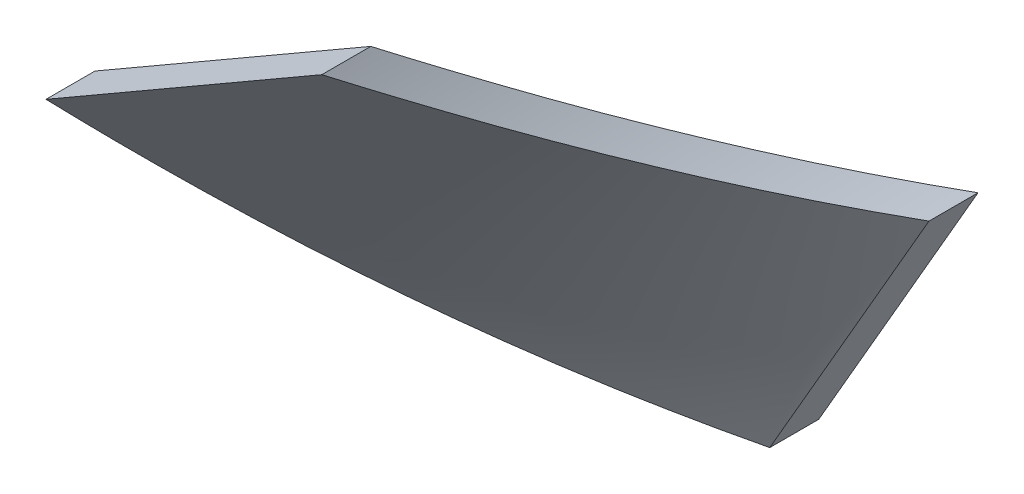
ISO-10303-21;
HEADER;
FILE_DESCRIPTION(('STEP AP214'),'2;1');
FILE_NAME('part.step','',(''),(''),'','','');
FILE_SCHEMA(('AUTOMOTIVE_DESIGN { 1 0 10303 214 1 1 1 1 }'));
ENDSEC;
DATA;
#1=APPLICATION_CONTEXT('core data for automotive mechanical design processes');
#2=APPLICATION_PROTOCOL_DEFINITION('international standard','automotive_design',2000,#1);
#3=PRODUCT_CONTEXT('',#1,'mechanical');
#4=PRODUCT('Part','Part','',(#3));
#5=PRODUCT_RELATED_PRODUCT_CATEGORY('part','',(#4));
#6=PRODUCT_DEFINITION_FORMATION('','',#4);
#7=PRODUCT_DEFINITION_CONTEXT('part definition',#1,'design');
#8=PRODUCT_DEFINITION('design','',#6,#7);
#9=PRODUCT_DEFINITION_SHAPE('','',#8);
#10=(LENGTH_UNIT() NAMED_UNIT(*) SI_UNIT(.MILLI.,.METRE.));
#11=(NAMED_UNIT(*) PLANE_ANGLE_UNIT() SI_UNIT($,.RADIAN.));
#12=(NAMED_UNIT(*) SI_UNIT($,.STERADIAN.) SOLID_ANGLE_UNIT());
#13=UNCERTAINTY_MEASURE_WITH_UNIT(LENGTH_MEASURE(1.E-05),#10,'distance_accuracy_value','');
#14=(GEOMETRIC_REPRESENTATION_CONTEXT(3) GLOBAL_UNCERTAINTY_ASSIGNED_CONTEXT((#13)) GLOBAL_UNIT_ASSIGNED_CONTEXT((#10,
#11,#12)) REPRESENTATION_CONTEXT('',''));
#15=CARTESIAN_POINT('',(0.,0.,0.));
#16=DIRECTION('',(0.,0.,1.));
#17=DIRECTION('',(1.,0.,0.));
#18=AXIS2_PLACEMENT_3D('',#15,#16,#17);
#19=CARTESIAN_POINT('',(-5.9999999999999,-10.3923048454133,2.));
#20=CARTESIAN_POINT('',(-6.96298885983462,-9.83632296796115,3.41176470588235));
#21=CARTESIAN_POINT('',(-7.80741960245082,-9.11285899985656,4.82352941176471));
#22=CARTESIAN_POINT('',(-8.65185034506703,-8.38939503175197,6.23529411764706));
#23=CARTESIAN_POINT('',(-9.34896689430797,-7.52308567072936,7.64705882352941));
#24=CARTESIAN_POINT('',(-9.92927662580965,-6.80193258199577,8.82227234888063));
#25=CARTESIAN_POINT('',(-10.3921239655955,-6.00031328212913,10.0002842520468));
#26=CARTESIAN_POINT('',(-10.4078274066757,-5.97311601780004,10.0402517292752));
#27=CARTESIAN_POINT('',(-10.4235308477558,-5.94591875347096,10.0802192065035));
#28=CARTESIAN_POINT('',(-9.24999999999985,-16.0214699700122,2.));
#29=CARTESIAN_POINT('',(-10.7346078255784,-15.1643312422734,3.41176470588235));
#30=CARTESIAN_POINT('',(-12.0364385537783,-14.0489909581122,4.82352941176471));
#31=CARTESIAN_POINT('',(-13.3382692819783,-12.933650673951,6.23529411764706));
#32=CARTESIAN_POINT('',(-14.4129906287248,-11.5980904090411,7.64705882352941));
#33=CARTESIAN_POINT('',(-15.3076347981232,-10.4863127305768,8.82227234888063));
#34=CARTESIAN_POINT('',(-16.0211911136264,-9.25048297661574,10.0002842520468));
#35=CARTESIAN_POINT('',(-16.0454005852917,-9.20855386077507,10.0402517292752));
#36=CARTESIAN_POINT('',(-16.0696100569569,-9.1666247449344,10.0802192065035));
#37=(BOUNDED_SURFACE() B_SPLINE_SURFACE(1,2,((#19,#20,#21,#22,#23,#24,#25,#26,#27),(#28,#29,#30,
#31,#32,#33,#34,#35,#36)),.UNSPECIFIED.,.F.,.F.,.F.) B_SPLINE_SURFACE_WITH_KNOTS((2,2),(3,2,2,2,
3),(0.,1.),(0.,0.0294117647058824,0.0588235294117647,0.0833246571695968,0.0841579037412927),
.UNSPECIFIED.) GEOMETRIC_REPRESENTATION_ITEM() RATIONAL_B_SPLINE_SURFACE(((1.,0.995734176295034,
1.,0.995734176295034,1.,0.996446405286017,0.99881337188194,0.99881337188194,0.99881337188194),
(1.,0.995734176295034,1.,0.995734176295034,1.,0.996446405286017,0.99881337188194,
0.99881337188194,0.99881337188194))) REPRESENTATION_ITEM('') SURFACE());
#38=CARTESIAN_POINT('',(-5.9999999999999,-10.3923048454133,2.));
#39=CARTESIAN_POINT('',(-6.96298885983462,-9.83632296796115,3.41176470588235));
#40=CARTESIAN_POINT('',(-7.80741960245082,-9.11285899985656,4.82352941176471));
#41=CARTESIAN_POINT('',(-8.65185034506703,-8.38939503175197,6.23529411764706));
#42=CARTESIAN_POINT('',(-9.34896689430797,-7.52308567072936,7.64705882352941));
#43=CARTESIAN_POINT('',(-9.92927662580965,-6.80193258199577,8.82227234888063));
#44=CARTESIAN_POINT('',(-10.3921239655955,-6.00031328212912,10.0002842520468));
#45=CARTESIAN_POINT('',(-10.4078274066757,-5.97311601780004,10.0402517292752));
#46=CARTESIAN_POINT('',(-10.4235308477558,-5.94591875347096,10.0802192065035));
#47=(BOUNDED_CURVE() B_SPLINE_CURVE(2,(#38,#39,#40,#41,#42,#43,#44,#45,#46),.UNSPECIFIED.,.F.,
.F.) B_SPLINE_CURVE_WITH_KNOTS((3,2,2,2,3),(0.,0.0294117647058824,0.0588235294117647,
0.0833246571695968,0.0841579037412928),
.UNSPECIFIED.) CURVE() GEOMETRIC_REPRESENTATION_ITEM() RATIONAL_B_SPLINE_CURVE((1.,
0.995734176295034,1.,0.995734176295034,1.,0.996446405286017,0.99881337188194,0.99881337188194,0.99881337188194)) REPRESENTATION_ITEM(''));
#48=CARTESIAN_POINT('',(-5.9999999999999,-10.3923048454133,2.));
#49=VERTEX_POINT('',#48);
#50=CARTESIAN_POINT('',(-10.3921551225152,-6.00025931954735,10.0002842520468));
#51=VERTEX_POINT('',#50);
#52=EDGE_CURVE('E131',#49,#51,#47,.T.);
#53=CARTESIAN_POINT('',(-10.3921862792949,-6.00020535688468,10.0004428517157));
#54=CARTESIAN_POINT('',(-10.8632876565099,-6.27220827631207,10.0004428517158));
#55=CARTESIAN_POINT('',(-11.334389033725,-6.54421119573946,10.0004428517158));
#56=CARTESIAN_POINT('',(-12.2765917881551,-7.08821703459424,10.0004428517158));
#57=CARTESIAN_POINT('',(-12.7476931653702,-7.36021995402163,10.0004428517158));
#58=CARTESIAN_POINT('',(-14.1529587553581,-8.17158744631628,10.0004428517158));
#59=CARTESIAN_POINT('',(-15.0871229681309,-8.71095201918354,10.0004428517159));
#60=CARTESIAN_POINT('',(-16.0212871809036,-9.2503165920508,10.0004428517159));
#61=B_SPLINE_CURVE_WITH_KNOTS('',3,(#53,#54,#55,#56,#57,#58,#59,#60),.UNSPECIFIED.,.F.,.F.,(4,2,
2,4),(0.,1.63196166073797,3.26392332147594,6.50000000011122),.UNSPECIFIED.);
#62=CARTESIAN_POINT('',(-16.0212631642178,-9.25035818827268,10.0003635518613));
#63=VERTEX_POINT('',#62);
#64=EDGE_CURVE('E61',#51,#63,#61,.T.);
#65=CARTESIAN_POINT('',(-9.24999999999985,-16.0214699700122,2.));
#66=CARTESIAN_POINT('',(-10.7346078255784,-15.1643312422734,3.41176470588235));
#67=CARTESIAN_POINT('',(-12.0364385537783,-14.0489909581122,4.82352941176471));
#68=CARTESIAN_POINT('',(-13.3382692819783,-12.933650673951,6.23529411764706));
#69=CARTESIAN_POINT('',(-14.4129906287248,-11.5980904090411,7.64705882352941));
#70=CARTESIAN_POINT('',(-15.3076347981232,-10.4863127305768,8.82227234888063));
#71=CARTESIAN_POINT('',(-16.0211911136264,-9.25048297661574,10.0002842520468));
#72=CARTESIAN_POINT('',(-16.0454005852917,-9.20855386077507,10.0402517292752));
#73=CARTESIAN_POINT('',(-16.0696100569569,-9.1666247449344,10.0802192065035));
#74=(BOUNDED_CURVE() B_SPLINE_CURVE(2,(#65,#66,#67,#68,#69,#70,#71,#72,#73),.UNSPECIFIED.,.F.,
.F.) B_SPLINE_CURVE_WITH_KNOTS((3,2,2,2,3),(0.,0.0294117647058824,0.0588235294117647,
0.0833246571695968,0.0841579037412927),
.UNSPECIFIED.) CURVE() GEOMETRIC_REPRESENTATION_ITEM() RATIONAL_B_SPLINE_CURVE((1.,
0.995734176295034,1.,0.995734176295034,1.,0.996446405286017,0.99881337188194,0.99881337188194,0.99881337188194)) REPRESENTATION_ITEM(''));
#75=CARTESIAN_POINT('',(-9.24999999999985,-16.0214699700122,2.));
#76=VERTEX_POINT('',#75);
#77=EDGE_CURVE('E58',#63,#76,#74,.F.);
#78=DIRECTION('',(0.499999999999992,0.866025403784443,0.));
#79=VECTOR('',#78,1.);
#80=CARTESIAN_POINT('',(-9.24999999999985,-16.0214699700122,2.));
#81=LINE('',#80,#79);
#82=EDGE_CURVE('E59',#49,#76,#81,.F.);
#83=ORIENTED_EDGE('',*,*,#52,.T.);
#84=ORIENTED_EDGE('',*,*,#64,.T.);
#85=ORIENTED_EDGE('',*,*,#77,.T.);
#86=ORIENTED_EDGE('',*,*,#82,.F.);
#87=EDGE_LOOP('',(#83,#84,#85,#86));
#88=FACE_BOUND('',#87,.T.);
#89=ADVANCED_FACE('F17',(#88),#37,.F.);
#90=CARTESIAN_POINT('',(-5.9999999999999,-10.3923048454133,1.));
#91=CARTESIAN_POINT('',(-6.96298885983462,-9.83632296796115,2.41176470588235));
#92=CARTESIAN_POINT('',(-7.80741960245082,-9.11285899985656,3.82352941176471));
#93=CARTESIAN_POINT('',(-8.65185034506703,-8.38939503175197,5.23529411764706));
#94=CARTESIAN_POINT('',(-9.34896689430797,-7.52308567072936,6.64705882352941));
#95=CARTESIAN_POINT('',(-9.92927662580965,-6.80193258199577,7.82227234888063));
#96=CARTESIAN_POINT('',(-10.3921239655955,-6.00031328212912,9.00028425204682));
#97=CARTESIAN_POINT('',(-10.4078274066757,-5.97311601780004,9.04025172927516));
#98=CARTESIAN_POINT('',(-10.4235308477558,-5.94591875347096,9.08021920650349));
#99=CARTESIAN_POINT('',(-5.9999999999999,-10.3923048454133,2.));
#100=CARTESIAN_POINT('',(-6.96298885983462,-9.83632296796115,3.41176470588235));
#101=CARTESIAN_POINT('',(-7.80741960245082,-9.11285899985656,4.82352941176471));
#102=CARTESIAN_POINT('',(-8.65185034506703,-8.38939503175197,6.23529411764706));
#103=CARTESIAN_POINT('',(-9.34896689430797,-7.52308567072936,7.64705882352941));
#104=CARTESIAN_POINT('',(-9.92927662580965,-6.80193258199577,8.82227234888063));
#105=CARTESIAN_POINT('',(-10.3921239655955,-6.00031328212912,10.0002842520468));
#106=CARTESIAN_POINT('',(-10.4078274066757,-5.97311601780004,10.0402517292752));
#107=CARTESIAN_POINT('',(-10.4235308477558,-5.94591875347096,10.0802192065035));
#108=(BOUNDED_SURFACE() B_SPLINE_SURFACE(1,2,((#90,#91,#92,#93,#94,#95,#96,#97,#98),(#99,#100,
#101,#102,#103,#104,#105,#106,#107)),.UNSPECIFIED.,.F.,.F.,.F.) B_SPLINE_SURFACE_WITH_KNOTS((2,
2),(3,2,2,2,3),(0.,1.),(0.,0.0294117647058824,0.0588235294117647,0.0833246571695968,
0.0841579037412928),
.UNSPECIFIED.) GEOMETRIC_REPRESENTATION_ITEM() RATIONAL_B_SPLINE_SURFACE(((1.,0.995734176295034,
1.,0.995734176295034,1.,0.996446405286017,0.99881337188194,0.99881337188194,0.99881337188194),
(1.,0.995734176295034,1.,0.995734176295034,1.,0.996446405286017,0.99881337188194,
0.99881337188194,0.99881337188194))) REPRESENTATION_ITEM('') SURFACE());
#109=CARTESIAN_POINT('',(-5.9999999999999,-10.3923048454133,1.));
#110=CARTESIAN_POINT('',(-6.96298885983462,-9.83632296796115,2.41176470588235));
#111=CARTESIAN_POINT('',(-7.80741960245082,-9.11285899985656,3.82352941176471));
#112=CARTESIAN_POINT('',(-8.65185034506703,-8.38939503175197,5.23529411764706));
#113=CARTESIAN_POINT('',(-9.34896689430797,-7.52308567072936,6.64705882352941));
#114=CARTESIAN_POINT('',(-9.92927662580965,-6.80193258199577,7.82227234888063));
#115=CARTESIAN_POINT('',(-10.3921239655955,-6.00031328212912,9.00028425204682));
#116=CARTESIAN_POINT('',(-10.4078274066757,-5.97311601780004,9.04025172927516));
#117=CARTESIAN_POINT('',(-10.4235308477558,-5.94591875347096,9.08021920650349));
#118=(BOUNDED_CURVE() B_SPLINE_CURVE(2,(#109,#110,#111,#112,#113,#114,#115,#116,#117),
.UNSPECIFIED.,.F.,.F.) B_SPLINE_CURVE_WITH_KNOTS((3,2,2,2,3),(0.,0.0294117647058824,
0.0588235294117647,0.0833246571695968,0.0841579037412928),
.UNSPECIFIED.) CURVE() GEOMETRIC_REPRESENTATION_ITEM() RATIONAL_B_SPLINE_CURVE((1.,
0.995734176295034,1.,0.995734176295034,1.,0.996446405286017,0.99881337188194,0.99881337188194,0.99881337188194)) REPRESENTATION_ITEM(''));
#119=CARTESIAN_POINT('',(-5.9999999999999,-10.3923048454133,1.));
#120=VERTEX_POINT('',#119);
#121=CARTESIAN_POINT('',(-10.3921862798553,-6.00020535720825,9.00044285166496));
#122=VERTEX_POINT('',#121);
#123=EDGE_CURVE('E70',#120,#122,#118,.T.);
#124=DIRECTION('',(0.,0.,1.));
#125=VECTOR('',#124,1.);
#126=CARTESIAN_POINT('',(-10.392186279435,-6.00020535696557,9.2504428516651));
#127=LINE('',#126,#125);
#128=EDGE_CURVE('E127',#122,#51,#127,.T.);
#129=DIRECTION('',(0.,0.,1.));
#130=VECTOR('',#129,1.);
#131=CARTESIAN_POINT('',(-5.9999999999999,-10.3923048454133,1.5));
#132=LINE('',#131,#130);
#133=EDGE_CURVE('E69',#120,#49,#132,.T.);
#134=ORIENTED_EDGE('',*,*,#123,.T.);
#135=ORIENTED_EDGE('',*,*,#128,.T.);
#136=ORIENTED_EDGE('',*,*,#52,.F.);
#137=ORIENTED_EDGE('',*,*,#133,.F.);
#138=EDGE_LOOP('',(#134,#135,#136,#137));
#139=FACE_BOUND('',#138,.T.);
#140=ADVANCED_FACE('F119',(#139),#108,.F.);
#141=CARTESIAN_POINT('',(-16.0212871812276,-9.25031659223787,9.2504428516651));
#142=DIRECTION('',(0.500017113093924,-0.86601552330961,0.));
#143=DIRECTION('',(0.86601552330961,0.500017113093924,0.));
#144=AXIS2_PLACEMENT_3D('',#141,#142,#143);
#145=PLANE('',#144);
#146=ORIENTED_EDGE('',*,*,#64,.F.);
#147=ORIENTED_EDGE('',*,*,#128,.F.);
#148=CARTESIAN_POINT('',(-10.3921862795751,-6.00020535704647,9.00044285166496));
#149=CARTESIAN_POINT('',(-10.8632876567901,-6.27220827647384,9.00044285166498));
#150=CARTESIAN_POINT('',(-11.3343890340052,-6.54421119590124,9.000442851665));
#151=CARTESIAN_POINT('',(-12.2765917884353,-7.08821703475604,9.00044285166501));
#152=CARTESIAN_POINT('',(-12.7476931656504,-7.36021995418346,9.000442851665));
#153=CARTESIAN_POINT('',(-14.152958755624,-8.17158744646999,9.00044285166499));
#154=CARTESIAN_POINT('',(-15.0871229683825,-8.71095201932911,9.00044285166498));
#155=CARTESIAN_POINT('',(-16.0212871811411,-9.25031659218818,9.000442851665));
#156=B_SPLINE_CURVE_WITH_KNOTS('',3,(#148,#149,#150,#151,#152,#153,#154,#155),.UNSPECIFIED.,.F.,
.F.,(4,2,2,4),(0.,1.63196166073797,3.26392332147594,6.50000000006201),.UNSPECIFIED.);
#157=CARTESIAN_POINT('',(-16.0212871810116,-9.25031659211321,9.0004428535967));
#158=VERTEX_POINT('',#157);
#159=EDGE_CURVE('E80',#122,#158,#156,.T.);
#160=ORIENTED_EDGE('',*,*,#159,.T.);
#161=DIRECTION('',(0.,0.,1.));
#162=VECTOR('',#161,1.);
#163=CARTESIAN_POINT('',(-16.0212871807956,-9.25031659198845,9.2504428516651));
#164=LINE('',#163,#162);
#165=EDGE_CURVE('E64',#158,#63,#164,.T.);
#166=ORIENTED_EDGE('',*,*,#165,.T.);
#167=EDGE_LOOP('',(#146,#147,#160,#166));
#168=FACE_BOUND('',#167,.T.);
#169=ADVANCED_FACE('F91',(#168),#145,.F.);
#170=CARTESIAN_POINT('',(-9.24999999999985,-16.0214699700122,2.));
#171=CARTESIAN_POINT('',(-10.7346078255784,-15.1643312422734,3.41176470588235));
#172=CARTESIAN_POINT('',(-12.0364385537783,-14.0489909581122,4.82352941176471));
#173=CARTESIAN_POINT('',(-13.3382692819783,-12.933650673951,6.23529411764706));
#174=CARTESIAN_POINT('',(-14.4129906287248,-11.5980904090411,7.64705882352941));
#175=CARTESIAN_POINT('',(-15.3076953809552,-10.4862374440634,8.82235193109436));
#176=CARTESIAN_POINT('',(-16.0212871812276,-9.25031659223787,10.0004428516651));
#177=CARTESIAN_POINT('',(-9.24999999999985,-16.0214699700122,1.));
#178=CARTESIAN_POINT('',(-10.7346078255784,-15.1643312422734,2.41176470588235));
#179=CARTESIAN_POINT('',(-12.0364385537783,-14.0489909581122,3.82352941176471));
#180=CARTESIAN_POINT('',(-13.3382692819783,-12.933650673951,5.23529411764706));
#181=CARTESIAN_POINT('',(-14.4129906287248,-11.5980904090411,6.64705882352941));
#182=CARTESIAN_POINT('',(-15.3076953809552,-10.4862374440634,7.82235193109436));
#183=CARTESIAN_POINT('',(-16.0212871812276,-9.25031659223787,9.0004428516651));
#184=(BOUNDED_SURFACE() B_SPLINE_SURFACE(1,2,((#170,#171,#172,#173,#174,#175,#176),(#177,#178,
#179,#180,#181,#182,#183)),.UNSPECIFIED.,.F.,.F.,.F.) B_SPLINE_SURFACE_WITH_KNOTS((2,2),(3,2,2,
3),(0.,1.),(0.,0.0294117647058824,0.0588235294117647,0.083326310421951),
.UNSPECIFIED.) GEOMETRIC_REPRESENTATION_ITEM() RATIONAL_B_SPLINE_SURFACE(((1.,0.995734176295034,
1.,0.995734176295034,1.,0.996446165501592,0.998813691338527),(1.,0.995734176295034,1.,
0.995734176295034,1.,0.996446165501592,0.998813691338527))) REPRESENTATION_ITEM('') SURFACE());
#185=CARTESIAN_POINT('',(-9.24999999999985,-16.0214699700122,1.));
#186=CARTESIAN_POINT('',(-10.7346078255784,-15.1643312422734,2.41176470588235));
#187=CARTESIAN_POINT('',(-12.0364385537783,-14.0489909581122,3.82352941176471));
#188=CARTESIAN_POINT('',(-13.3382692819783,-12.933650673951,5.23529411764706));
#189=CARTESIAN_POINT('',(-14.4129906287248,-11.5980904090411,6.64705882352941));
#190=CARTESIAN_POINT('',(-15.3076953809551,-10.4862374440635,7.82235193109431));
#191=CARTESIAN_POINT('',(-16.0212871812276,-9.25031659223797,9.000442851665));
#192=(BOUNDED_CURVE() B_SPLINE_CURVE(2,(#185,#186,#187,#188,#189,#190,#191),.UNSPECIFIED.,.F.,
.F.) B_SPLINE_CURVE_WITH_KNOTS((3,2,2,3),(0.,0.0294117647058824,0.0588235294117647,
0.0833263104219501),
.UNSPECIFIED.) CURVE() GEOMETRIC_REPRESENTATION_ITEM() RATIONAL_B_SPLINE_CURVE((1.,
0.995734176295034,1.,0.995734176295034,1.,0.996446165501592,0.998813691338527)) REPRESENTATION_ITEM(''));
#193=CARTESIAN_POINT('',(-9.24999999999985,-16.0214699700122,1.));
#194=VERTEX_POINT('',#193);
#195=EDGE_CURVE('E29',#158,#194,#192,.F.);
#196=DIRECTION('',(0.,0.,1.));
#197=VECTOR('',#196,1.);
#198=CARTESIAN_POINT('',(-9.24999999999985,-16.0214699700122,1.5));
#199=LINE('',#198,#197);
#200=EDGE_CURVE('E37',#76,#194,#199,.F.);
#201=ORIENTED_EDGE('',*,*,#77,.F.);
#202=ORIENTED_EDGE('',*,*,#165,.F.);
#203=ORIENTED_EDGE('',*,*,#195,.T.);
#204=ORIENTED_EDGE('',*,*,#200,.F.);
#205=EDGE_LOOP('',(#201,#202,#203,#204));
#206=FACE_BOUND('',#205,.T.);
#207=ADVANCED_FACE('F73',(#206),#184,.F.);
#208=CARTESIAN_POINT('',(-9.24999999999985,-16.0214699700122,1.5));
#209=DIRECTION('',(0.866025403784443,-0.499999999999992,0.));
#210=DIRECTION('',(0.499999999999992,0.866025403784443,0.));
#211=AXIS2_PLACEMENT_3D('',#208,#209,#210);
#212=PLANE('',#211);
#213=ORIENTED_EDGE('',*,*,#133,.T.);
#214=ORIENTED_EDGE('',*,*,#82,.T.);
#215=ORIENTED_EDGE('',*,*,#200,.T.);
#216=DIRECTION('',(0.499999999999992,0.866025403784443,0.));
#217=VECTOR('',#216,1.);
#218=CARTESIAN_POINT('',(-7.62499999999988,-13.2068874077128,1.));
#219=LINE('',#218,#217);
#220=EDGE_CURVE('E11',#194,#120,#219,.T.);
#221=ORIENTED_EDGE('',*,*,#220,.T.);
#222=EDGE_LOOP('',(#213,#214,#215,#221));
#223=FACE_BOUND('',#222,.T.);
#224=ADVANCED_FACE('F67',(#223),#212,.T.);
#225=CARTESIAN_POINT('',(-9.24999999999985,-16.0214699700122,1.));
#226=CARTESIAN_POINT('',(-10.7346078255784,-15.1643312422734,2.41176470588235));
#227=CARTESIAN_POINT('',(-12.0364385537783,-14.0489909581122,3.82352941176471));
#228=CARTESIAN_POINT('',(-13.3382692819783,-12.933650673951,5.23529411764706));
#229=CARTESIAN_POINT('',(-14.4129906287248,-11.5980904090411,6.64705882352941));
#230=CARTESIAN_POINT('',(-15.3076953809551,-10.4862374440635,7.82235193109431));
#231=CARTESIAN_POINT('',(-16.0212871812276,-9.25031659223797,9.000442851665));
#232=CARTESIAN_POINT('',(-5.9999999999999,-10.3923048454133,1.));
#233=CARTESIAN_POINT('',(-6.96298885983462,-9.83632296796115,2.41176470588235));
#234=CARTESIAN_POINT('',(-7.80741960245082,-9.11285899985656,3.82352941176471));
#235=CARTESIAN_POINT('',(-8.65185034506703,-8.38939503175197,5.23529411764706));
#236=CARTESIAN_POINT('',(-9.34896689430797,-7.52308567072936,6.64705882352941));
#237=CARTESIAN_POINT('',(-9.9293159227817,-6.80188374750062,7.82235193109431));
#238=CARTESIAN_POINT('',(-10.3921862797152,-6.00020535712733,9.000442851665));
#239=(BOUNDED_SURFACE() B_SPLINE_SURFACE(1,2,((#225,#226,#227,#228,#229,#230,#231),(#232,#233,
#234,#235,#236,#237,#238)),.UNSPECIFIED.,.F.,.F.,.F.) B_SPLINE_SURFACE_WITH_KNOTS((2,2),(3,2,2,
3),(0.,1.),(0.,0.0294117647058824,0.0588235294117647,0.0833263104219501),
.UNSPECIFIED.) GEOMETRIC_REPRESENTATION_ITEM() RATIONAL_B_SPLINE_SURFACE(((1.,0.995734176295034,
1.,0.995734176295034,1.,0.996446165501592,0.998813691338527),(1.,0.995734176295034,1.,
0.995734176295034,1.,0.996446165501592,0.998813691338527))) REPRESENTATION_ITEM('') SURFACE());
#240=ORIENTED_EDGE('',*,*,#195,.F.);
#241=ORIENTED_EDGE('',*,*,#159,.F.);
#242=ORIENTED_EDGE('',*,*,#123,.F.);
#243=ORIENTED_EDGE('',*,*,#220,.F.);
#244=EDGE_LOOP('',(#240,#241,#242,#243));
#245=FACE_BOUND('',#244,.T.);
#246=ADVANCED_FACE('F94',(#245),#239,.F.);
#247=CLOSED_SHELL('',(#89,#140,#169,#207,#224,#246));
#248=MANIFOLD_SOLID_BREP('B1',#247);
#249=ADVANCED_BREP_SHAPE_REPRESENTATION('',(#18,#248),#14);
#250=SHAPE_DEFINITION_REPRESENTATION(#9,#249);
ENDSEC;
END-ISO-10303-21;
